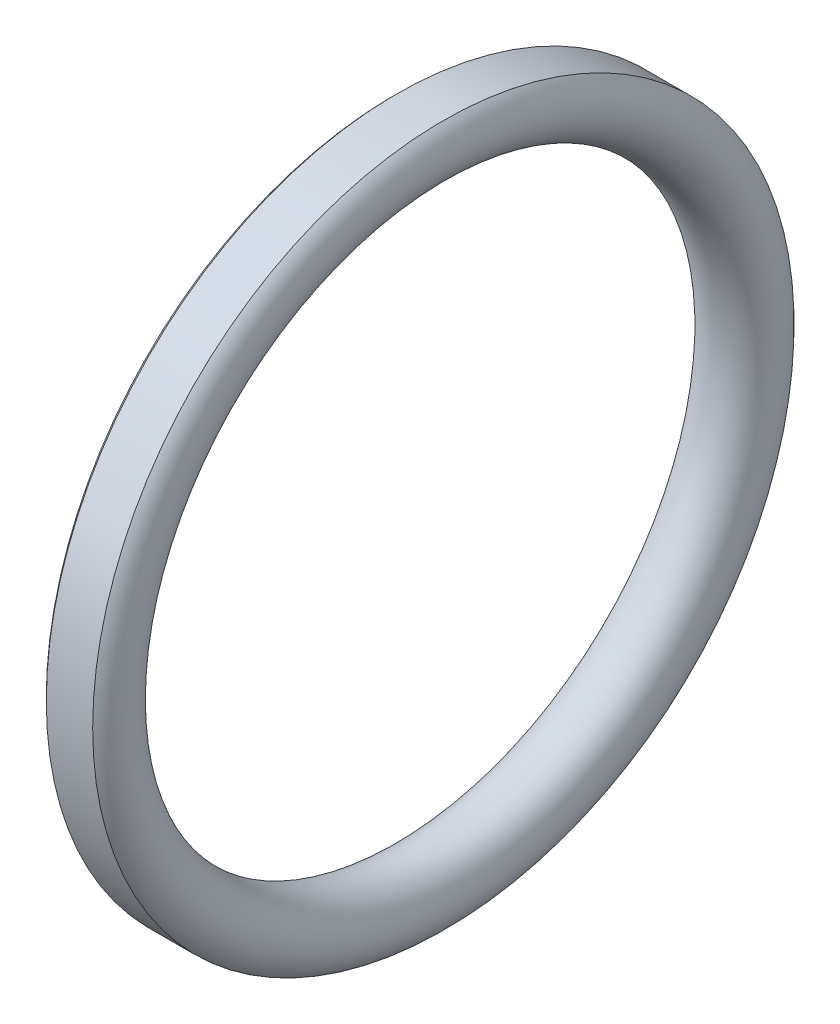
ISO-10303-21;
HEADER;
FILE_DESCRIPTION(('STEP AP214'),'2;1');
FILE_NAME('part.step','',(''),(''),'','','');
FILE_SCHEMA(('AUTOMOTIVE_DESIGN { 1 0 10303 214 1 1 1 1 }'));
ENDSEC;
DATA;
#1=APPLICATION_CONTEXT('core data for automotive mechanical design processes');
#2=APPLICATION_PROTOCOL_DEFINITION('international standard','automotive_design',2000,#1);
#3=PRODUCT_CONTEXT('',#1,'mechanical');
#4=PRODUCT('Part','Part','',(#3));
#5=PRODUCT_RELATED_PRODUCT_CATEGORY('part','',(#4));
#6=PRODUCT_DEFINITION_FORMATION('','',#4);
#7=PRODUCT_DEFINITION_CONTEXT('part definition',#1,'design');
#8=PRODUCT_DEFINITION('design','',#6,#7);
#9=PRODUCT_DEFINITION_SHAPE('','',#8);
#10=(LENGTH_UNIT() NAMED_UNIT(*) SI_UNIT(.MILLI.,.METRE.));
#11=(NAMED_UNIT(*) PLANE_ANGLE_UNIT() SI_UNIT($,.RADIAN.));
#12=(NAMED_UNIT(*) SI_UNIT($,.STERADIAN.) SOLID_ANGLE_UNIT());
#13=UNCERTAINTY_MEASURE_WITH_UNIT(LENGTH_MEASURE(1.E-05),#10,'distance_accuracy_value','');
#14=(GEOMETRIC_REPRESENTATION_CONTEXT(3) GLOBAL_UNCERTAINTY_ASSIGNED_CONTEXT((#13)) GLOBAL_UNIT_ASSIGNED_CONTEXT((#10,
#11,#12)) REPRESENTATION_CONTEXT('',''));
#15=CARTESIAN_POINT('',(0.,0.,0.));
#16=DIRECTION('',(0.,0.,1.));
#17=DIRECTION('',(1.,0.,0.));
#18=AXIS2_PLACEMENT_3D('',#15,#16,#17);
#19=CARTESIAN_POINT('',(0.,0.,0.));
#20=DIRECTION('',(-1.,0.,0.));
#21=DIRECTION('',(0.,0.,1.));
#22=AXIS2_PLACEMENT_3D('',#19,#20,#21);
#23=TOROIDAL_SURFACE('',#22,9.25,1.);
#24=CARTESIAN_POINT('',(0.661437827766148,0.,0.));
#25=DIRECTION('',(-1.,0.,0.));
#26=DIRECTION('',(0.,0.,1.));
#27=AXIS2_PLACEMENT_3D('',#24,#25,#26);
#28=CIRCLE('',#27,10.);
#29=CARTESIAN_POINT('',(0.661437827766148,0.,10.));
#30=VERTEX_POINT('',#29);
#31=EDGE_CURVE('E10',#30,#30,#28,.T.);
#32=ORIENTED_EDGE('',*,*,#31,.F.);
#33=EDGE_LOOP('',(#32));
#34=FACE_BOUND('',#33,.T.);
#35=CARTESIAN_POINT('',(-0.66143782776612,0.,0.));
#36=DIRECTION('',(-1.,0.,0.));
#37=DIRECTION('',(0.,0.,1.));
#38=AXIS2_PLACEMENT_3D('',#35,#36,#37);
#39=CIRCLE('',#38,10.);
#40=CARTESIAN_POINT('',(-0.661437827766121,0.,10.));
#41=VERTEX_POINT('',#40);
#42=EDGE_CURVE('E33',#41,#41,#39,.T.);
#43=ORIENTED_EDGE('',*,*,#42,.T.);
#44=EDGE_LOOP('',(#43));
#45=FACE_BOUND('',#44,.T.);
#46=ADVANCED_FACE('F27',(#34,#45),#23,.T.);
#47=CARTESIAN_POINT('',(-18.,0.,0.));
#48=DIRECTION('',(-1.,0.,0.));
#49=DIRECTION('',(0.,0.,1.));
#50=AXIS2_PLACEMENT_3D('',#47,#48,#49);
#51=CYLINDRICAL_SURFACE('',#50,10.);
#52=ORIENTED_EDGE('',*,*,#42,.F.);
#53=EDGE_LOOP('',(#52));
#54=FACE_BOUND('',#53,.T.);
#55=ORIENTED_EDGE('',*,*,#31,.T.);
#56=EDGE_LOOP('',(#55));
#57=FACE_BOUND('',#56,.T.);
#58=ADVANCED_FACE('F40',(#54,#57),#51,.T.);
#59=CLOSED_SHELL('',(#46,#58));
#60=MANIFOLD_SOLID_BREP('B2',#59);
#61=ADVANCED_BREP_SHAPE_REPRESENTATION('',(#18,#60),#14);
#62=SHAPE_DEFINITION_REPRESENTATION(#9,#61);
ENDSEC;
END-ISO-10303-21;
